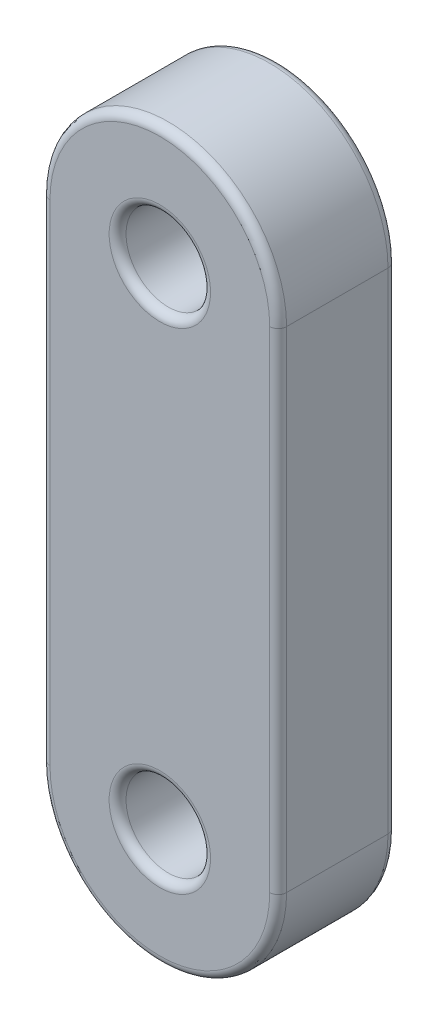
from build123d import *

# Parameters (mm, degrees)
SKETCH_1_R      = 2.5
EXTRUDE_1_DEPTH = 3.5
FILLET_1_R      = 0.5


with BuildPart() as part:
    # Sketch 1 → Extrude 1 (new, symmetric)
    with BuildSketch(Plane.XY):
        with BuildLine():
            Line((-7, 14.5), (-7, -14.5))
            ThreePointArc((-7, -14.5), (0, -21.5), (7, -14.5))
            Line((7, -14.5), (7, 14.5))
            ThreePointArc((7, 14.5), (0, 21.5), (-7, 14.5))
        make_face()
        with Locations((0, 14.5)):
            Circle(SKETCH_1_R, mode=Mode.SUBTRACT)
        with Locations((0, -14.5)):
            Circle(SKETCH_1_R, mode=Mode.SUBTRACT)
    extrude(amount=EXTRUDE_1_DEPTH, both=True)

    # Fillet 1
    fillet_1_edges = [part.edges().sort_by_distance(p)[0] for p in [
        (0, -21.5, 3.5),
        (-2.5, 14.5, -3.5),
        (-2.5, 14.5, 3.5),
        (7, 0, 3.5),
        (-2.5, -14.5, -3.5),
        (-2.5, -14.5, 3.5),
        (0, 21.5, 3.5),
        (7, 0, -3.5),
        (0, -21.5, -3.5),
        (-7, 0, -3.5),
        (0, 21.5, -3.5),
        (-7, 0, 3.5),
    ]]
    fillet(fillet_1_edges, radius=FILLET_1_R)


solid = part.part
